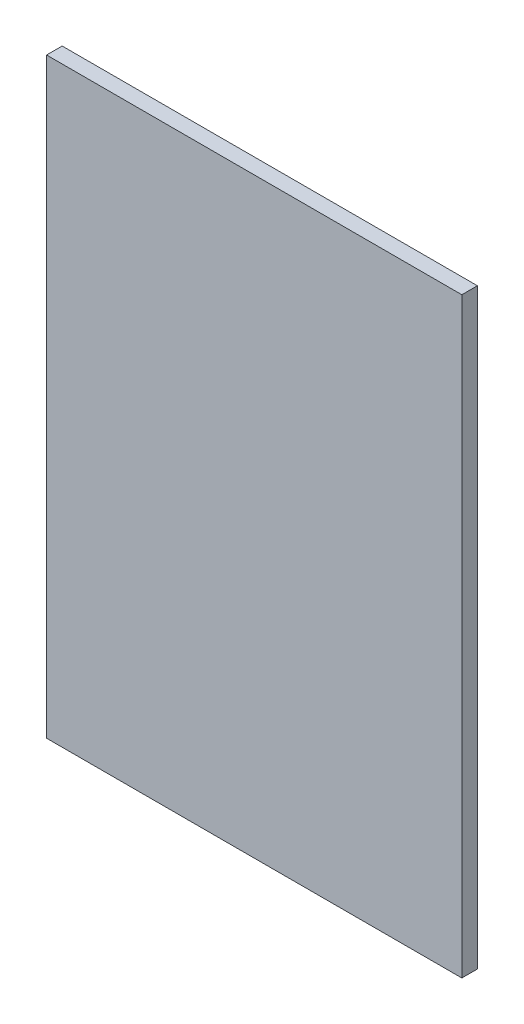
ISO-10303-21;
HEADER;
FILE_DESCRIPTION(('STEP AP214'),'2;1');
FILE_NAME('part.step','',(''),(''),'','','');
FILE_SCHEMA(('AUTOMOTIVE_DESIGN { 1 0 10303 214 1 1 1 1 }'));
ENDSEC;
DATA;
#1=APPLICATION_CONTEXT('core data for automotive mechanical design processes');
#2=APPLICATION_PROTOCOL_DEFINITION('international standard','automotive_design',2000,#1);
#3=PRODUCT_CONTEXT('',#1,'mechanical');
#4=PRODUCT('Part','Part','',(#3));
#5=PRODUCT_RELATED_PRODUCT_CATEGORY('part','',(#4));
#6=PRODUCT_DEFINITION_FORMATION('','',#4);
#7=PRODUCT_DEFINITION_CONTEXT('part definition',#1,'design');
#8=PRODUCT_DEFINITION('design','',#6,#7);
#9=PRODUCT_DEFINITION_SHAPE('','',#8);
#10=(LENGTH_UNIT() NAMED_UNIT(*) SI_UNIT(.MILLI.,.METRE.));
#11=(NAMED_UNIT(*) PLANE_ANGLE_UNIT() SI_UNIT($,.RADIAN.));
#12=(NAMED_UNIT(*) SI_UNIT($,.STERADIAN.) SOLID_ANGLE_UNIT());
#13=UNCERTAINTY_MEASURE_WITH_UNIT(LENGTH_MEASURE(1.E-05),#10,'distance_accuracy_value','');
#14=(GEOMETRIC_REPRESENTATION_CONTEXT(3) GLOBAL_UNCERTAINTY_ASSIGNED_CONTEXT((#13)) GLOBAL_UNIT_ASSIGNED_CONTEXT((#10,
#11,#12)) REPRESENTATION_CONTEXT('',''));
#15=CARTESIAN_POINT('',(0.,0.,0.));
#16=DIRECTION('',(0.,0.,1.));
#17=DIRECTION('',(1.,0.,0.));
#18=AXIS2_PLACEMENT_3D('',#15,#16,#17);
#19=CARTESIAN_POINT('',(200.,285.,15.));
#20=DIRECTION('',(-1.,0.,0.));
#21=DIRECTION('',(0.,0.,1.));
#22=AXIS2_PLACEMENT_3D('',#19,#20,#21);
#23=PLANE('',#22);
#24=DIRECTION('',(0.,1.,0.));
#25=VECTOR('',#24,1.);
#26=CARTESIAN_POINT('',(200.,285.,0.));
#27=LINE('',#26,#25);
#28=CARTESIAN_POINT('',(200.,-285.,0.));
#29=VERTEX_POINT('',#28);
#30=CARTESIAN_POINT('',(200.,285.,0.));
#31=VERTEX_POINT('',#30);
#32=EDGE_CURVE('E111',#29,#31,#27,.T.);
#33=ORIENTED_EDGE('',*,*,#32,.T.);
#34=DIRECTION('',(0.,0.,-1.));
#35=VECTOR('',#34,1.);
#36=CARTESIAN_POINT('',(200.,285.,15.));
#37=LINE('',#36,#35);
#38=CARTESIAN_POINT('',(200.,285.,15.));
#39=VERTEX_POINT('',#38);
#40=EDGE_CURVE('E11',#39,#31,#37,.T.);
#41=ORIENTED_EDGE('',*,*,#40,.F.);
#42=DIRECTION('',(0.,1.,0.));
#43=VECTOR('',#42,1.);
#44=CARTESIAN_POINT('',(200.,285.,15.));
#45=LINE('',#44,#43);
#46=CARTESIAN_POINT('',(200.,-285.,15.));
#47=VERTEX_POINT('',#46);
#48=EDGE_CURVE('E95',#47,#39,#45,.T.);
#49=ORIENTED_EDGE('',*,*,#48,.F.);
#50=DIRECTION('',(0.,0.,-1.));
#51=VECTOR('',#50,1.);
#52=CARTESIAN_POINT('',(200.,-285.,15.));
#53=LINE('',#52,#51);
#54=EDGE_CURVE('E107',#47,#29,#53,.T.);
#55=ORIENTED_EDGE('',*,*,#54,.T.);
#56=EDGE_LOOP('',(#33,#41,#49,#55));
#57=FACE_BOUND('',#56,.T.);
#58=ADVANCED_FACE('F43',(#57),#23,.F.);
#59=CARTESIAN_POINT('',(-200.,285.,15.));
#60=DIRECTION('',(0.,-1.,0.));
#61=DIRECTION('',(0.,0.,-1.));
#62=AXIS2_PLACEMENT_3D('',#59,#60,#61);
#63=PLANE('',#62);
#64=DIRECTION('',(-1.,0.,0.));
#65=VECTOR('',#64,1.);
#66=CARTESIAN_POINT('',(-200.,285.,0.));
#67=LINE('',#66,#65);
#68=CARTESIAN_POINT('',(-200.,285.,0.));
#69=VERTEX_POINT('',#68);
#70=EDGE_CURVE('E100',#31,#69,#67,.T.);
#71=ORIENTED_EDGE('',*,*,#70,.T.);
#72=DIRECTION('',(0.,0.,-1.));
#73=VECTOR('',#72,1.);
#74=CARTESIAN_POINT('',(-200.,285.,15.));
#75=LINE('',#74,#73);
#76=CARTESIAN_POINT('',(-200.,285.,15.));
#77=VERTEX_POINT('',#76);
#78=EDGE_CURVE('E52',#77,#69,#75,.T.);
#79=ORIENTED_EDGE('',*,*,#78,.F.);
#80=DIRECTION('',(-1.,0.,0.));
#81=VECTOR('',#80,1.);
#82=CARTESIAN_POINT('',(-200.,285.,15.));
#83=LINE('',#82,#81);
#84=EDGE_CURVE('E90',#39,#77,#83,.T.);
#85=ORIENTED_EDGE('',*,*,#84,.F.);
#86=ORIENTED_EDGE('',*,*,#40,.T.);
#87=EDGE_LOOP('',(#71,#79,#85,#86));
#88=FACE_BOUND('',#87,.T.);
#89=ADVANCED_FACE('F99',(#88),#63,.F.);
#90=CARTESIAN_POINT('',(-200.,285.,15.));
#91=DIRECTION('',(1.,0.,0.));
#92=DIRECTION('',(0.,1.,0.));
#93=AXIS2_PLACEMENT_3D('',#90,#91,#92);
#94=PLANE('',#93);
#95=DIRECTION('',(0.,-1.,0.));
#96=VECTOR('',#95,1.);
#97=CARTESIAN_POINT('',(-200.,285.,0.));
#98=LINE('',#97,#96);
#99=CARTESIAN_POINT('',(-200.,-285.,0.));
#100=VERTEX_POINT('',#99);
#101=EDGE_CURVE('E77',#69,#100,#98,.T.);
#102=ORIENTED_EDGE('',*,*,#101,.T.);
#103=DIRECTION('',(0.,0.,-1.));
#104=VECTOR('',#103,1.);
#105=CARTESIAN_POINT('',(-200.,-285.,15.));
#106=LINE('',#105,#104);
#107=CARTESIAN_POINT('',(-200.,-285.,15.));
#108=VERTEX_POINT('',#107);
#109=EDGE_CURVE('E102',#108,#100,#106,.T.);
#110=ORIENTED_EDGE('',*,*,#109,.F.);
#111=DIRECTION('',(0.,-1.,0.));
#112=VECTOR('',#111,1.);
#113=CARTESIAN_POINT('',(-200.,285.,15.));
#114=LINE('',#113,#112);
#115=EDGE_CURVE('E93',#77,#108,#114,.T.);
#116=ORIENTED_EDGE('',*,*,#115,.F.);
#117=ORIENTED_EDGE('',*,*,#78,.T.);
#118=EDGE_LOOP('',(#102,#110,#116,#117));
#119=FACE_BOUND('',#118,.T.);
#120=ADVANCED_FACE('F103',(#119),#94,.F.);
#121=CARTESIAN_POINT('',(-200.,-285.,15.));
#122=DIRECTION('',(0.,1.,0.));
#123=DIRECTION('',(0.,0.,1.));
#124=AXIS2_PLACEMENT_3D('',#121,#122,#123);
#125=PLANE('',#124);
#126=DIRECTION('',(1.,0.,0.));
#127=VECTOR('',#126,1.);
#128=CARTESIAN_POINT('',(-200.,-285.,0.));
#129=LINE('',#128,#127);
#130=EDGE_CURVE('E83',#100,#29,#129,.T.);
#131=ORIENTED_EDGE('',*,*,#130,.T.);
#132=ORIENTED_EDGE('',*,*,#54,.F.);
#133=DIRECTION('',(1.,0.,0.));
#134=VECTOR('',#133,1.);
#135=CARTESIAN_POINT('',(-200.,-285.,15.));
#136=LINE('',#135,#134);
#137=EDGE_CURVE('E60',#108,#47,#136,.T.);
#138=ORIENTED_EDGE('',*,*,#137,.F.);
#139=ORIENTED_EDGE('',*,*,#109,.T.);
#140=EDGE_LOOP('',(#131,#132,#138,#139));
#141=FACE_BOUND('',#140,.T.);
#142=ADVANCED_FACE('F124',(#141),#125,.F.);
#143=CARTESIAN_POINT('',(0.,0.,15.));
#144=DIRECTION('',(0.,0.,1.));
#145=DIRECTION('',(1.,0.,0.));
#146=AXIS2_PLACEMENT_3D('',#143,#144,#145);
#147=PLANE('',#146);
#148=ORIENTED_EDGE('',*,*,#48,.T.);
#149=ORIENTED_EDGE('',*,*,#84,.T.);
#150=ORIENTED_EDGE('',*,*,#115,.T.);
#151=ORIENTED_EDGE('',*,*,#137,.T.);
#152=EDGE_LOOP('',(#148,#149,#150,#151));
#153=FACE_BOUND('',#152,.T.);
#154=ADVANCED_FACE('F91',(#153),#147,.T.);
#155=CARTESIAN_POINT('',(0.,0.,0.));
#156=DIRECTION('',(0.,0.,1.));
#157=DIRECTION('',(1.,0.,0.));
#158=AXIS2_PLACEMENT_3D('',#155,#156,#157);
#159=PLANE('',#158);
#160=ORIENTED_EDGE('',*,*,#32,.F.);
#161=ORIENTED_EDGE('',*,*,#130,.F.);
#162=ORIENTED_EDGE('',*,*,#101,.F.);
#163=ORIENTED_EDGE('',*,*,#70,.F.);
#164=EDGE_LOOP('',(#160,#161,#162,#163));
#165=FACE_BOUND('',#164,.T.);
#166=ADVANCED_FACE('F127',(#165),#159,.F.);
#167=CLOSED_SHELL('',(#58,#89,#120,#142,#154,#166));
#168=MANIFOLD_SOLID_BREP('B2',#167);
#169=ADVANCED_BREP_SHAPE_REPRESENTATION('',(#18,#168),#14);
#170=SHAPE_DEFINITION_REPRESENTATION(#9,#169);
ENDSEC;
END-ISO-10303-21;
